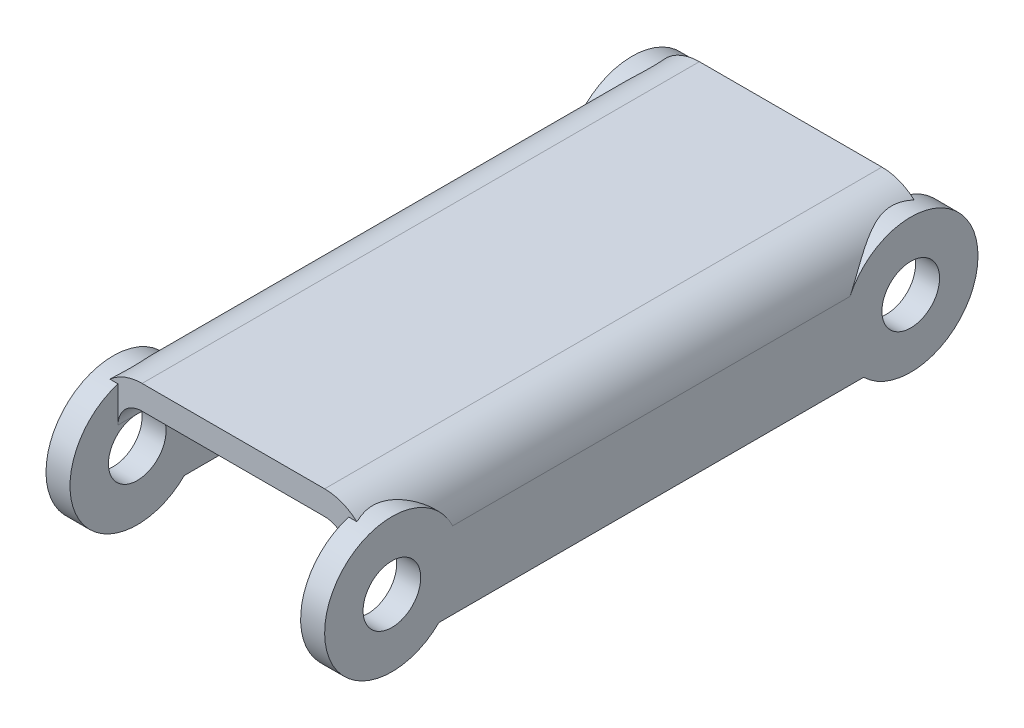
ISO-10303-21;
HEADER;
FILE_DESCRIPTION(('STEP AP214'),'2;1');
FILE_NAME('part.step','',(''),(''),'','','');
FILE_SCHEMA(('AUTOMOTIVE_DESIGN { 1 0 10303 214 1 1 1 1 }'));
ENDSEC;
DATA;
#1=APPLICATION_CONTEXT('core data for automotive mechanical design processes');
#2=APPLICATION_PROTOCOL_DEFINITION('international standard','automotive_design',2000,#1);
#3=PRODUCT_CONTEXT('',#1,'mechanical');
#4=PRODUCT('Part','Part','',(#3));
#5=PRODUCT_RELATED_PRODUCT_CATEGORY('part','',(#4));
#6=PRODUCT_DEFINITION_FORMATION('','',#4);
#7=PRODUCT_DEFINITION_CONTEXT('part definition',#1,'design');
#8=PRODUCT_DEFINITION('design','',#6,#7);
#9=PRODUCT_DEFINITION_SHAPE('','',#8);
#10=(LENGTH_UNIT() NAMED_UNIT(*) SI_UNIT(.MILLI.,.METRE.));
#11=(NAMED_UNIT(*) PLANE_ANGLE_UNIT() SI_UNIT($,.RADIAN.));
#12=(NAMED_UNIT(*) SI_UNIT($,.STERADIAN.) SOLID_ANGLE_UNIT());
#13=UNCERTAINTY_MEASURE_WITH_UNIT(LENGTH_MEASURE(1.E-05),#10,'distance_accuracy_value','');
#14=(GEOMETRIC_REPRESENTATION_CONTEXT(3) GLOBAL_UNCERTAINTY_ASSIGNED_CONTEXT((#13)) GLOBAL_UNIT_ASSIGNED_CONTEXT((#10,
#11,#12)) REPRESENTATION_CONTEXT('',''));
#15=CARTESIAN_POINT('',(0.,0.,0.));
#16=DIRECTION('',(0.,0.,1.));
#17=DIRECTION('',(1.,0.,0.));
#18=AXIS2_PLACEMENT_3D('',#15,#16,#17);
#19=CARTESIAN_POINT('',(-6.,4.,0.));
#20=DIRECTION('',(1.,0.,0.));
#21=DIRECTION('',(0.,0.,-1.));
#22=AXIS2_PLACEMENT_3D('',#19,#20,#21);
#23=PLANE('',#22);
#24=DIRECTION('',(0.,0.,-1.));
#25=VECTOR('',#24,1.);
#26=CARTESIAN_POINT('',(-6.,4.,0.));
#27=LINE('',#26,#25);
#28=CARTESIAN_POINT('',(-6.,4.,1.));
#29=VERTEX_POINT('',#28);
#30=CARTESIAN_POINT('',(-6.,4.,27.9999999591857));
#31=VERTEX_POINT('',#30);
#32=EDGE_CURVE('E34',#29,#31,#27,.F.);
#33=ORIENTED_EDGE('',*,*,#32,.T.);
#34=CARTESIAN_POINT('',(-6.,2.5,28.));
#35=DIRECTION('',(-1.,0.,0.));
#36=DIRECTION('',(0.,-1.,0.));
#37=AXIS2_PLACEMENT_3D('',#34,#35,#36);
#38=CIRCLE('',#37,1.5);
#39=CARTESIAN_POINT('',(-6.,0.999999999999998,28.));
#40=VERTEX_POINT('',#39);
#41=EDGE_CURVE('E118',#31,#40,#38,.T.);
#42=ORIENTED_EDGE('',*,*,#41,.T.);
#43=EDGE_CURVE('E108',#40,#31,#38,.T.);
#44=ORIENTED_EDGE('',*,*,#43,.T.);
#45=CARTESIAN_POINT('',(-6.,4.,29.));
#46=VERTEX_POINT('',#45);
#47=EDGE_CURVE('E302',#31,#46,#27,.F.);
#48=ORIENTED_EDGE('',*,*,#47,.T.);
#49=DIRECTION('',(0.,1.,0.));
#50=VECTOR('',#49,1.);
#51=CARTESIAN_POINT('',(-6.00000000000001,4.18092071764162,29.));
#52=LINE('',#51,#50);
#53=CARTESIAN_POINT('',(-6.00000000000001,5.85410196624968,29.));
#54=VERTEX_POINT('',#53);
#55=EDGE_CURVE('E156',#54,#46,#52,.F.);
#56=ORIENTED_EDGE('',*,*,#55,.F.);
#57=CARTESIAN_POINT('',(-6.00000000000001,2.5,28.));
#58=DIRECTION('',(-1.,0.,0.));
#59=DIRECTION('',(0.,-1.,0.));
#60=AXIS2_PLACEMENT_3D('',#57,#58,#59);
#61=CIRCLE('',#60,3.5);
#62=CARTESIAN_POINT('',(-6.,0.,25.5505102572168));
#63=VERTEX_POINT('',#62);
#64=EDGE_CURVE('E166',#63,#54,#61,.T.);
#65=ORIENTED_EDGE('',*,*,#64,.F.);
#66=DIRECTION('',(0.,0.,-1.));
#67=VECTOR('',#66,1.);
#68=CARTESIAN_POINT('',(-6.,0.,0.));
#69=LINE('',#68,#67);
#70=CARTESIAN_POINT('',(-6.,0.,3.44948974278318));
#71=VERTEX_POINT('',#70);
#72=EDGE_CURVE('E171',#63,#71,#69,.T.);
#73=ORIENTED_EDGE('',*,*,#72,.T.);
#74=CARTESIAN_POINT('',(-6.,2.5,1.));
#75=DIRECTION('',(-1.,0.,0.));
#76=DIRECTION('',(0.,-1.,0.));
#77=AXIS2_PLACEMENT_3D('',#74,#75,#76);
#78=CIRCLE('',#77,3.5);
#79=CARTESIAN_POINT('',(-6.,5.85410196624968,0.));
#80=VERTEX_POINT('',#79);
#81=EDGE_CURVE('E174',#80,#71,#78,.T.);
#82=ORIENTED_EDGE('',*,*,#81,.F.);
#83=DIRECTION('',(0.,1.,0.));
#84=VECTOR('',#83,1.);
#85=CARTESIAN_POINT('',(-6.,4.,0.));
#86=LINE('',#85,#84);
#87=CARTESIAN_POINT('',(-6.,4.,0.));
#88=VERTEX_POINT('',#87);
#89=EDGE_CURVE('E153',#80,#88,#86,.F.);
#90=ORIENTED_EDGE('',*,*,#89,.T.);
#91=EDGE_CURVE('E106',#88,#29,#27,.F.);
#92=ORIENTED_EDGE('',*,*,#91,.T.);
#93=CARTESIAN_POINT('',(-6.,2.5,1.));
#94=DIRECTION('',(-1.,0.,0.));
#95=DIRECTION('',(0.,0.,1.));
#96=AXIS2_PLACEMENT_3D('',#93,#94,#95);
#97=CIRCLE('',#96,1.5);
#98=CARTESIAN_POINT('',(-6.,2.5,2.5));
#99=VERTEX_POINT('',#98);
#100=EDGE_CURVE('E102',#29,#99,#97,.T.);
#101=ORIENTED_EDGE('',*,*,#100,.T.);
#102=EDGE_CURVE('E104',#99,#29,#97,.T.);
#103=ORIENTED_EDGE('',*,*,#102,.T.);
#104=EDGE_LOOP('',(#33,#42,#44,#48,#56,#65,#73,#82,#90,#92,#101,#103));
#105=FACE_BOUND('',#104,.T.);
#106=ADVANCED_FACE('F16',(#105),#23,.T.);
#107=CARTESIAN_POINT('',(0.,4.18092071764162,0.));
#108=DIRECTION('',(0.,0.,1.));
#109=DIRECTION('',(1.,0.,0.));
#110=AXIS2_PLACEMENT_3D('',#107,#108,#109);
#111=PLANE('',#110);
#112=DIRECTION('',(1.,0.,0.));
#113=VECTOR('',#112,1.);
#114=CARTESIAN_POINT('',(0.,5.85410196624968,0.));
#115=LINE('',#114,#113);
#116=CARTESIAN_POINT('',(-6.42699311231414,5.85410196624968,0.));
#117=VERTEX_POINT('',#116);
#118=EDGE_CURVE('E181',#117,#80,#115,.T.);
#119=ORIENTED_EDGE('',*,*,#118,.F.);
#120=CARTESIAN_POINT('',(-4.75,4.,0.));
#121=DIRECTION('',(0.,0.,1.));
#122=DIRECTION('',(1.,0.,0.));
#123=AXIS2_PLACEMENT_3D('',#120,#121,#122);
#124=CIRCLE('',#123,2.5);
#125=CARTESIAN_POINT('',(-4.75,6.5,0.));
#126=VERTEX_POINT('',#125);
#127=EDGE_CURVE('E184',#126,#117,#124,.T.);
#128=ORIENTED_EDGE('',*,*,#127,.F.);
#129=DIRECTION('',(1.,0.,0.));
#130=VECTOR('',#129,1.);
#131=CARTESIAN_POINT('',(-4.75,6.5,0.));
#132=LINE('',#131,#130);
#133=CARTESIAN_POINT('',(4.75,6.5,0.));
#134=VERTEX_POINT('',#133);
#135=EDGE_CURVE('E458',#134,#126,#132,.F.);
#136=ORIENTED_EDGE('',*,*,#135,.F.);
#137=CARTESIAN_POINT('',(4.75,4.,0.));
#138=DIRECTION('',(0.,0.,1.));
#139=DIRECTION('',(1.,0.,0.));
#140=AXIS2_PLACEMENT_3D('',#137,#138,#139);
#141=CIRCLE('',#140,2.5);
#142=CARTESIAN_POINT('',(6.42699311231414,5.85410196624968,0.));
#143=VERTEX_POINT('',#142);
#144=EDGE_CURVE('E147',#143,#134,#141,.T.);
#145=ORIENTED_EDGE('',*,*,#144,.F.);
#146=DIRECTION('',(1.,0.,0.));
#147=VECTOR('',#146,1.);
#148=CARTESIAN_POINT('',(6.00000000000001,5.85410196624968,0.));
#149=LINE('',#148,#147);
#150=CARTESIAN_POINT('',(6.,5.85410196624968,0.));
#151=VERTEX_POINT('',#150);
#152=EDGE_CURVE('E144',#151,#143,#149,.T.);
#153=ORIENTED_EDGE('',*,*,#152,.F.);
#154=DIRECTION('',(0.,1.,0.));
#155=VECTOR('',#154,1.);
#156=CARTESIAN_POINT('',(6.,4.92705098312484,0.));
#157=LINE('',#156,#155);
#158=CARTESIAN_POINT('',(6.,4.,0.));
#159=VERTEX_POINT('',#158);
#160=EDGE_CURVE('E92',#159,#151,#157,.T.);
#161=ORIENTED_EDGE('',*,*,#160,.F.);
#162=CARTESIAN_POINT('',(4.75,4.,0.));
#163=DIRECTION('',(0.,0.,1.));
#164=DIRECTION('',(1.,0.,0.));
#165=AXIS2_PLACEMENT_3D('',#162,#163,#164);
#166=CIRCLE('',#165,1.25);
#167=CARTESIAN_POINT('',(4.75,5.25,0.));
#168=VERTEX_POINT('',#167);
#169=EDGE_CURVE('E146',#168,#159,#166,.F.);
#170=ORIENTED_EDGE('',*,*,#169,.F.);
#171=DIRECTION('',(1.,0.,0.));
#172=VECTOR('',#171,1.);
#173=CARTESIAN_POINT('',(0.,5.25,0.));
#174=LINE('',#173,#172);
#175=CARTESIAN_POINT('',(-4.75,5.25,0.));
#176=VERTEX_POINT('',#175);
#177=EDGE_CURVE('E149',#176,#168,#174,.T.);
#178=ORIENTED_EDGE('',*,*,#177,.F.);
#179=CARTESIAN_POINT('',(-4.75,4.,0.));
#180=DIRECTION('',(0.,0.,1.));
#181=DIRECTION('',(1.,0.,0.));
#182=AXIS2_PLACEMENT_3D('',#179,#180,#181);
#183=CIRCLE('',#182,1.25);
#184=EDGE_CURVE('E150',#88,#176,#183,.F.);
#185=ORIENTED_EDGE('',*,*,#184,.F.);
#186=ORIENTED_EDGE('',*,*,#89,.F.);
#187=EDGE_LOOP('',(#119,#128,#136,#145,#153,#161,#170,#178,#185,#186));
#188=FACE_BOUND('',#187,.T.);
#189=ADVANCED_FACE('F261',(#188),#111,.F.);
#190=CARTESIAN_POINT('',(0.,4.18092071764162,29.));
#191=DIRECTION('',(0.,0.,1.));
#192=DIRECTION('',(1.,0.,0.));
#193=AXIS2_PLACEMENT_3D('',#190,#191,#192);
#194=PLANE('',#193);
#195=CARTESIAN_POINT('',(-4.75,4.,29.));
#196=DIRECTION('',(0.,0.,1.));
#197=DIRECTION('',(1.,0.,0.));
#198=AXIS2_PLACEMENT_3D('',#195,#196,#197);
#199=CIRCLE('',#198,2.5);
#200=CARTESIAN_POINT('',(-6.42699311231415,5.85410196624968,29.));
#201=VERTEX_POINT('',#200);
#202=CARTESIAN_POINT('',(-4.75,6.5,29.));
#203=VERTEX_POINT('',#202);
#204=EDGE_CURVE('E155',#201,#203,#199,.F.);
#205=ORIENTED_EDGE('',*,*,#204,.F.);
#206=DIRECTION('',(1.,0.,0.));
#207=VECTOR('',#206,1.);
#208=CARTESIAN_POINT('',(0.,5.85410196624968,29.));
#209=LINE('',#208,#207);
#210=EDGE_CURVE('E160',#201,#54,#209,.T.);
#211=ORIENTED_EDGE('',*,*,#210,.T.);
#212=ORIENTED_EDGE('',*,*,#55,.T.);
#213=CARTESIAN_POINT('',(-4.75,4.,29.));
#214=DIRECTION('',(0.,0.,1.));
#215=DIRECTION('',(1.,0.,0.));
#216=AXIS2_PLACEMENT_3D('',#213,#214,#215);
#217=CIRCLE('',#216,1.25);
#218=CARTESIAN_POINT('',(-4.75,5.25,29.));
#219=VERTEX_POINT('',#218);
#220=EDGE_CURVE('E159',#46,#219,#217,.F.);
#221=ORIENTED_EDGE('',*,*,#220,.T.);
#222=DIRECTION('',(1.,0.,0.));
#223=VECTOR('',#222,1.);
#224=CARTESIAN_POINT('',(0.,5.25,29.));
#225=LINE('',#224,#223);
#226=CARTESIAN_POINT('',(4.75,5.25,29.));
#227=VERTEX_POINT('',#226);
#228=EDGE_CURVE('E131',#219,#227,#225,.T.);
#229=ORIENTED_EDGE('',*,*,#228,.T.);
#230=CARTESIAN_POINT('',(4.75,4.,29.));
#231=DIRECTION('',(0.,0.,1.));
#232=DIRECTION('',(1.,0.,0.));
#233=AXIS2_PLACEMENT_3D('',#230,#231,#232);
#234=CIRCLE('',#233,1.25);
#235=CARTESIAN_POINT('',(6.,4.,29.));
#236=VERTEX_POINT('',#235);
#237=EDGE_CURVE('E127',#227,#236,#234,.F.);
#238=ORIENTED_EDGE('',*,*,#237,.T.);
#239=DIRECTION('',(0.,1.,0.));
#240=VECTOR('',#239,1.);
#241=CARTESIAN_POINT('',(6.,4.92705098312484,29.));
#242=LINE('',#241,#240);
#243=CARTESIAN_POINT('',(6.,5.85410196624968,29.));
#244=VERTEX_POINT('',#243);
#245=EDGE_CURVE('E189',#236,#244,#242,.T.);
#246=ORIENTED_EDGE('',*,*,#245,.T.);
#247=DIRECTION('',(1.,0.,0.));
#248=VECTOR('',#247,1.);
#249=CARTESIAN_POINT('',(0.,5.85410196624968,29.));
#250=LINE('',#249,#248);
#251=CARTESIAN_POINT('',(6.42699311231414,5.85410196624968,29.));
#252=VERTEX_POINT('',#251);
#253=EDGE_CURVE('E130',#244,#252,#250,.T.);
#254=ORIENTED_EDGE('',*,*,#253,.T.);
#255=CARTESIAN_POINT('',(4.75,4.,29.));
#256=DIRECTION('',(0.,0.,1.));
#257=DIRECTION('',(1.,0.,0.));
#258=AXIS2_PLACEMENT_3D('',#255,#256,#257);
#259=CIRCLE('',#258,2.5);
#260=CARTESIAN_POINT('',(4.75,6.5,29.));
#261=VERTEX_POINT('',#260);
#262=EDGE_CURVE('E134',#261,#252,#259,.F.);
#263=ORIENTED_EDGE('',*,*,#262,.F.);
#264=DIRECTION('',(1.,0.,0.));
#265=VECTOR('',#264,1.);
#266=CARTESIAN_POINT('',(-4.75,6.5,29.));
#267=LINE('',#266,#265);
#268=EDGE_CURVE('E167',#203,#261,#267,.T.);
#269=ORIENTED_EDGE('',*,*,#268,.F.);
#270=EDGE_LOOP('',(#205,#211,#212,#221,#229,#238,#246,#254,#263,#269));
#271=FACE_BOUND('',#270,.T.);
#272=ADVANCED_FACE('F264',(#271),#194,.T.);
#273=CARTESIAN_POINT('',(-6.,2.5,28.));
#274=DIRECTION('',(-1.,0.,0.));
#275=DIRECTION('',(0.,-1.,0.));
#276=AXIS2_PLACEMENT_3D('',#273,#274,#275);
#277=CYLINDRICAL_SURFACE('',#276,3.5);
#278=DIRECTION('',(1.,0.,0.));
#279=VECTOR('',#278,1.);
#280=CARTESIAN_POINT('',(-6.,0.,25.5505102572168));
#281=LINE('',#280,#279);
#282=CARTESIAN_POINT('',(-7.25,0.,25.5505102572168));
#283=VERTEX_POINT('',#282);
#284=EDGE_CURVE('E163',#63,#283,#281,.F.);
#285=ORIENTED_EDGE('',*,*,#284,.F.);
#286=ORIENTED_EDGE('',*,*,#64,.T.);
#287=ORIENTED_EDGE('',*,*,#210,.F.);
#288=CARTESIAN_POINT('',(-7.25,4.00000000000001,24.8377223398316));
#289=CARTESIAN_POINT('',(-7.25000848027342,4.0707857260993,24.8712794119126));
#290=CARTESIAN_POINT('',(-7.24699492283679,4.14037838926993,24.9072196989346));
#291=CARTESIAN_POINT('',(-7.23559098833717,4.27656009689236,24.9833996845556));
#292=CARTESIAN_POINT('',(-7.22721003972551,4.34315418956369,25.0236317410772));
#293=CARTESIAN_POINT('',(-7.20585107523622,4.47226500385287,25.1075884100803));
#294=CARTESIAN_POINT('',(-7.1929241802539,4.53481826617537,25.1512701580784));
#295=CARTESIAN_POINT('',(-7.16311349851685,4.65635681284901,25.2421220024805));
#296=CARTESIAN_POINT('',(-7.14622760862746,4.71534017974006,25.2892939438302));
#297=CARTESIAN_POINT('',(-7.0811048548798,4.9157656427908,25.4604065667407));
#298=CARTESIAN_POINT('',(-7.02400217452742,5.04736575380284,25.5928028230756));
#299=CARTESIAN_POINT('',(-6.92963102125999,5.22630337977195,25.8032146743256));
#300=CARTESIAN_POINT('',(-6.89659513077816,5.28303150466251,25.8755851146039));
#301=CARTESIAN_POINT('',(-6.82873119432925,5.39028431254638,26.0239895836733));
#302=CARTESIAN_POINT('',(-6.79390392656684,5.4408116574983,26.1000220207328));
#303=CARTESIAN_POINT('',(-6.72277286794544,5.53682326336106,26.2574670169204));
#304=CARTESIAN_POINT('',(-6.68645378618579,5.58215434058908,26.3389655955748));
#305=CARTESIAN_POINT('',(-6.61453470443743,5.66630475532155,26.5056011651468));
#306=CARTESIAN_POINT('',(-6.57893489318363,5.70512240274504,26.590739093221));
#307=CARTESIAN_POINT('',(-6.51019042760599,5.77599515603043,26.7644328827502));
#308=CARTESIAN_POINT('',(-6.47703883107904,5.8080699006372,26.8529779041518));
#309=CARTESIAN_POINT('',(-6.41506511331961,5.86529787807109,27.0336923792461));
#310=CARTESIAN_POINT('',(-6.38624010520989,5.89045573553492,27.1258593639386));
#311=CARTESIAN_POINT('',(-6.3279362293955,5.93957897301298,27.3407205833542));
#312=CARTESIAN_POINT('',(-6.30063089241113,5.96114277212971,27.4646028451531));
#313=CARTESIAN_POINT('',(-6.26244533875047,5.9907635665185,27.7162520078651));
#314=CARTESIAN_POINT('',(-6.25151493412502,5.99886184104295,27.844005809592));
#315=CARTESIAN_POINT('',(-6.24878036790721,6.00091667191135,28.100307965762));
#316=CARTESIAN_POINT('',(-6.25704586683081,5.99482172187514,28.2288575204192));
#317=CARTESIAN_POINT('',(-6.29067523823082,5.96893858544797,28.4825093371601));
#318=CARTESIAN_POINT('',(-6.31608761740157,5.94911154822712,28.6076007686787));
#319=CARTESIAN_POINT('',(-6.35920898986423,5.91329000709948,28.775677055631));
#320=CARTESIAN_POINT('',(-6.37185499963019,5.90260233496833,28.8212660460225));
#321=CARTESIAN_POINT('',(-6.39848345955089,5.87957777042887,28.9113715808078));
#322=CARTESIAN_POINT('',(-6.41245897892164,5.86724931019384,28.9558923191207));
#323=CARTESIAN_POINT('',(-6.42699311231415,5.85410196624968,29.));
#324=B_SPLINE_CURVE_WITH_KNOTS('',3,(#288,#289,#290,#291,#292,#293,#294,#295,#296,#297,#298,
#299,#300,#301,#302,#303,#304,#305,#306,#307,#308,#309,#310,#311,#312,#313,#314,#315,#316,#317,
#318,#319,#320,#321,#322,#323),.UNSPECIFIED.,.F.,.F.,(4,2,2,2,2,2,2,2,2,2,2,2,2,2,2,2,2,4),(0.,
0.234824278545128,0.469237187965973,0.701094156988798,0.93307457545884,1.51502190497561,
1.80797310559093,2.10079810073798,2.40076999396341,2.70081960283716,2.99998282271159,
3.29894553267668,3.68346375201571,4.06680102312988,4.45153156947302,4.8373550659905,
4.98282805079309,5.12758039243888),.UNSPECIFIED.);
#325=CARTESIAN_POINT('',(-7.25,4.,24.8377223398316));
#326=VERTEX_POINT('',#325);
#327=EDGE_CURVE('E170',#326,#201,#324,.T.);
#328=ORIENTED_EDGE('',*,*,#327,.F.);
#329=CARTESIAN_POINT('',(-7.25,2.5,28.));
#330=DIRECTION('',(-1.,0.,0.));
#331=DIRECTION('',(0.,-1.,0.));
#332=AXIS2_PLACEMENT_3D('',#329,#330,#331);
#333=CIRCLE('',#332,3.5);
#334=EDGE_CURVE('E284',#326,#283,#333,.F.);
#335=ORIENTED_EDGE('',*,*,#334,.T.);
#336=EDGE_LOOP('',(#285,#286,#287,#328,#335));
#337=FACE_BOUND('',#336,.T.);
#338=ADVANCED_FACE('F267',(#337),#277,.T.);
#339=CARTESIAN_POINT('',(-6.,2.5,1.));
#340=DIRECTION('',(-1.,0.,0.));
#341=DIRECTION('',(0.,-1.,0.));
#342=AXIS2_PLACEMENT_3D('',#339,#340,#341);
#343=CYLINDRICAL_SURFACE('',#342,3.5);
#344=CARTESIAN_POINT('',(-7.25000000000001,2.5,1.));
#345=DIRECTION('',(-1.,0.,0.));
#346=DIRECTION('',(0.,-1.,0.));
#347=AXIS2_PLACEMENT_3D('',#344,#345,#346);
#348=CIRCLE('',#347,3.5);
#349=CARTESIAN_POINT('',(-7.25,4.,4.16227766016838));
#350=VERTEX_POINT('',#349);
#351=CARTESIAN_POINT('',(-7.25,0.,3.44948974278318));
#352=VERTEX_POINT('',#351);
#353=EDGE_CURVE('E298',#350,#352,#348,.T.);
#354=ORIENTED_EDGE('',*,*,#353,.F.);
#355=CARTESIAN_POINT('',(-6.42699311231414,5.85410196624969,0.));
#356=CARTESIAN_POINT('',(-6.40675659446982,5.87241408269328,0.0614595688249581));
#357=CARTESIAN_POINT('',(-6.38758319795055,5.88914674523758,0.123725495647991));
#358=CARTESIAN_POINT('',(-6.35211088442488,5.91931517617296,0.249976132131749));
#359=CARTESIAN_POINT('',(-6.335817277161,5.93274487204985,0.313963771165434));
#360=CARTESIAN_POINT('',(-6.29259716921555,5.96769280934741,0.507846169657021));
#361=CARTESIAN_POINT('',(-6.27116921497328,5.98400858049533,0.640117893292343));
#362=CARTESIAN_POINT('',(-6.25393094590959,5.99705391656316,0.841163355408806));
#363=CARTESIAN_POINT('',(-6.25069427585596,5.99947776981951,0.909019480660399));
#364=CARTESIAN_POINT('',(-6.24950856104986,6.00037009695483,1.0448303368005));
#365=CARTESIAN_POINT('',(-6.25156015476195,5.99883809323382,1.11278507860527));
#366=CARTESIAN_POINT('',(-6.26080509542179,5.99185803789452,1.2480024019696));
#367=CARTESIAN_POINT('',(-6.26798873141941,5.98641738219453,1.31526604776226));
#368=CARTESIAN_POINT('',(-6.28697326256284,5.97176493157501,1.44873584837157));
#369=CARTESIAN_POINT('',(-6.29877702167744,5.962550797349,1.51494132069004));
#370=CARTESIAN_POINT('',(-6.34739302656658,5.92362066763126,1.74640191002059));
#371=CARTESIAN_POINT('',(-6.39480195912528,5.88413035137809,1.90789800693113));
#372=CARTESIAN_POINT('',(-6.47536473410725,5.80955070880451,2.14177623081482));
#373=CARTESIAN_POINT('',(-6.50388405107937,5.7820379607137,2.21853773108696));
#374=CARTESIAN_POINT('',(-6.56283788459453,5.72203033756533,2.3693369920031));
#375=CARTESIAN_POINT('',(-6.59327193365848,5.68953667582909,2.44337541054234));
#376=CARTESIAN_POINT('',(-6.68940330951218,5.58063866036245,2.66999672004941));
#377=CARTESIAN_POINT('',(-6.75652713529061,5.49571959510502,2.81796246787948));
#378=CARTESIAN_POINT('',(-6.88593469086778,5.30428217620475,3.10121853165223));
#379=CARTESIAN_POINT('',(-6.9482259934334,5.19779860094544,3.23652875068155));
#380=CARTESIAN_POINT('',(-7.05303563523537,4.97911550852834,3.47517204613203));
#381=CARTESIAN_POINT('',(-7.09709266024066,4.86968407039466,3.58034832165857));
#382=CARTESIAN_POINT('',(-7.17102492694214,4.63532593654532,3.77734573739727));
#383=CARTESIAN_POINT('',(-7.20094242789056,4.51044683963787,3.86920609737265));
#384=CARTESIAN_POINT('',(-7.23039750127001,4.31841716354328,3.99140970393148));
#385=CARTESIAN_POINT('',(-7.23761747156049,4.25646039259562,4.02820892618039));
#386=CARTESIAN_POINT('',(-7.24742374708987,4.1300160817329,4.09810947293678));
#387=CARTESIAN_POINT('',(-7.25000255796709,4.06552462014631,4.13120473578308));
#388=CARTESIAN_POINT('',(-7.25,4.,4.16227766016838));
#389=B_SPLINE_CURVE_WITH_KNOTS('',3,(#355,#356,#357,#358,#359,#360,#361,#362,#363,#364,#365,
#366,#367,#368,#369,#370,#371,#372,#373,#374,#375,#376,#377,#378,#379,#380,#381,#382,#383,#384,
#385,#386,#387,#388),.UNSPECIFIED.,.F.,.F.,(4,2,2,2,2,2,2,2,2,2,2,2,2,2,2,2,4),(0.,
0.20166082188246,0.403689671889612,0.806246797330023,1.00990143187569,1.21358065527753,
1.41687549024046,1.62029654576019,2.13558825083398,2.39464094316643,2.65363063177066,
3.20183544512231,3.74916307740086,4.22172033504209,4.69285617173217,4.90986927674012,
5.12723249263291),.UNSPECIFIED.);
#390=EDGE_CURVE('E178',#117,#350,#389,.T.);
#391=ORIENTED_EDGE('',*,*,#390,.F.);
#392=ORIENTED_EDGE('',*,*,#118,.T.);
#393=ORIENTED_EDGE('',*,*,#81,.T.);
#394=DIRECTION('',(-1.,0.,0.));
#395=VECTOR('',#394,1.);
#396=CARTESIAN_POINT('',(-6.625,0.,3.44948974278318));
#397=LINE('',#396,#395);
#398=EDGE_CURVE('E177',#71,#352,#397,.T.);
#399=ORIENTED_EDGE('',*,*,#398,.T.);
#400=EDGE_LOOP('',(#354,#391,#392,#393,#399));
#401=FACE_BOUND('',#400,.T.);
#402=ADVANCED_FACE('F272',(#401),#343,.T.);
#403=CARTESIAN_POINT('',(-6.,0.,0.));
#404=DIRECTION('',(0.,-1.,0.));
#405=DIRECTION('',(0.,0.,-1.));
#406=AXIS2_PLACEMENT_3D('',#403,#404,#405);
#407=PLANE('',#406);
#408=ORIENTED_EDGE('',*,*,#284,.T.);
#409=DIRECTION('',(0.,0.,1.));
#410=VECTOR('',#409,1.);
#411=CARTESIAN_POINT('',(-7.25,0.,0.));
#412=LINE('',#411,#410);
#413=EDGE_CURVE('E173',#352,#283,#412,.T.);
#414=ORIENTED_EDGE('',*,*,#413,.F.);
#415=ORIENTED_EDGE('',*,*,#398,.F.);
#416=ORIENTED_EDGE('',*,*,#72,.F.);
#417=EDGE_LOOP('',(#408,#414,#415,#416));
#418=FACE_BOUND('',#417,.T.);
#419=ADVANCED_FACE('F468',(#418),#407,.T.);
#420=CARTESIAN_POINT('',(-4.75,4.,0.));
#421=DIRECTION('',(0.,0.,1.));
#422=DIRECTION('',(1.,0.,0.));
#423=AXIS2_PLACEMENT_3D('',#420,#421,#422);
#424=CYLINDRICAL_SURFACE('',#423,1.25);
#425=ORIENTED_EDGE('',*,*,#47,.F.);
#426=ORIENTED_EDGE('',*,*,#32,.F.);
#427=ORIENTED_EDGE('',*,*,#91,.F.);
#428=ORIENTED_EDGE('',*,*,#184,.T.);
#429=DIRECTION('',(0.,0.,-1.));
#430=VECTOR('',#429,1.);
#431=CARTESIAN_POINT('',(-4.75,5.25,0.));
#432=LINE('',#431,#430);
#433=EDGE_CURVE('E303',#219,#176,#432,.T.);
#434=ORIENTED_EDGE('',*,*,#433,.F.);
#435=ORIENTED_EDGE('',*,*,#220,.F.);
#436=EDGE_LOOP('',(#425,#426,#427,#428,#434,#435));
#437=FACE_BOUND('',#436,.T.);
#438=ADVANCED_FACE('F479',(#437),#424,.F.);
#439=CARTESIAN_POINT('',(4.75,4.,0.));
#440=DIRECTION('',(0.,0.,1.));
#441=DIRECTION('',(1.,0.,0.));
#442=AXIS2_PLACEMENT_3D('',#439,#440,#441);
#443=CYLINDRICAL_SURFACE('',#442,1.25);
#444=DIRECTION('',(0.,0.,1.));
#445=VECTOR('',#444,1.);
#446=CARTESIAN_POINT('',(4.75,5.25,0.));
#447=LINE('',#446,#445);
#448=EDGE_CURVE('E139',#168,#227,#447,.T.);
#449=ORIENTED_EDGE('',*,*,#448,.F.);
#450=ORIENTED_EDGE('',*,*,#169,.T.);
#451=DIRECTION('',(0.,0.,1.));
#452=VECTOR('',#451,1.);
#453=CARTESIAN_POINT('',(6.,4.,14.5));
#454=LINE('',#453,#452);
#455=CARTESIAN_POINT('',(6.,4.,1.));
#456=VERTEX_POINT('',#455);
#457=EDGE_CURVE('E19',#159,#456,#454,.T.);
#458=ORIENTED_EDGE('',*,*,#457,.T.);
#459=DIRECTION('',(0.,0.,1.));
#460=VECTOR('',#459,1.);
#461=CARTESIAN_POINT('',(6.,4.,14.5));
#462=LINE('',#461,#460);
#463=CARTESIAN_POINT('',(6.,4.,28.));
#464=VERTEX_POINT('',#463);
#465=EDGE_CURVE('E126',#456,#464,#462,.T.);
#466=ORIENTED_EDGE('',*,*,#465,.T.);
#467=DIRECTION('',(0.,0.,1.));
#468=VECTOR('',#467,1.);
#469=CARTESIAN_POINT('',(6.,4.,14.5));
#470=LINE('',#469,#468);
#471=EDGE_CURVE('E25',#464,#236,#470,.T.);
#472=ORIENTED_EDGE('',*,*,#471,.T.);
#473=ORIENTED_EDGE('',*,*,#237,.F.);
#474=EDGE_LOOP('',(#449,#450,#458,#466,#472,#473));
#475=FACE_BOUND('',#474,.T.);
#476=ADVANCED_FACE('F206',(#475),#443,.F.);
#477=CARTESIAN_POINT('',(6.,2.5,28.));
#478=DIRECTION('',(1.,0.,0.));
#479=DIRECTION('',(0.,1.,0.));
#480=AXIS2_PLACEMENT_3D('',#477,#478,#479);
#481=CYLINDRICAL_SURFACE('',#480,3.5);
#482=ORIENTED_EDGE('',*,*,#253,.F.);
#483=CARTESIAN_POINT('',(6.,2.5,28.));
#484=DIRECTION('',(1.,0.,0.));
#485=DIRECTION('',(0.,1.,0.));
#486=AXIS2_PLACEMENT_3D('',#483,#484,#485);
#487=CIRCLE('',#486,3.5);
#488=CARTESIAN_POINT('',(6.,0.,25.5505102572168));
#489=VERTEX_POINT('',#488);
#490=EDGE_CURVE('E187',#244,#489,#487,.T.);
#491=ORIENTED_EDGE('',*,*,#490,.T.);
#492=DIRECTION('',(1.,0.,0.));
#493=VECTOR('',#492,1.);
#494=CARTESIAN_POINT('',(6.,0.,25.5505102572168));
#495=LINE('',#494,#493);
#496=CARTESIAN_POINT('',(7.25,0.,25.5505102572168));
#497=VERTEX_POINT('',#496);
#498=EDGE_CURVE('E135',#489,#497,#495,.T.);
#499=ORIENTED_EDGE('',*,*,#498,.T.);
#500=CARTESIAN_POINT('',(7.25,2.5,28.));
#501=DIRECTION('',(1.,0.,0.));
#502=DIRECTION('',(0.,1.,0.));
#503=AXIS2_PLACEMENT_3D('',#500,#501,#502);
#504=CIRCLE('',#503,3.5);
#505=CARTESIAN_POINT('',(7.25,4.,24.8377223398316));
#506=VERTEX_POINT('',#505);
#507=EDGE_CURVE('E138',#506,#497,#504,.T.);
#508=ORIENTED_EDGE('',*,*,#507,.F.);
#509=CARTESIAN_POINT('',(6.42699311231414,5.85410196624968,29.));
#510=CARTESIAN_POINT('',(6.40675659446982,5.87241408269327,28.938540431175));
#511=CARTESIAN_POINT('',(6.38758319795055,5.88914674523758,28.876274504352));
#512=CARTESIAN_POINT('',(6.35211088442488,5.91931517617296,28.7500238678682));
#513=CARTESIAN_POINT('',(6.335817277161,5.93274487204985,28.6860362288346));
#514=CARTESIAN_POINT('',(6.29259716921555,5.96769280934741,28.492153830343));
#515=CARTESIAN_POINT('',(6.27116921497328,5.98400858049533,28.3598821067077));
#516=CARTESIAN_POINT('',(6.25393094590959,5.99705391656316,28.1588366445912));
#517=CARTESIAN_POINT('',(6.25069427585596,5.9994777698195,28.0909805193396));
#518=CARTESIAN_POINT('',(6.24950856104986,6.00037009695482,27.9551696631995));
#519=CARTESIAN_POINT('',(6.25156015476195,5.99883809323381,27.8872149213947));
#520=CARTESIAN_POINT('',(6.26080509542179,5.99185803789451,27.7519975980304));
#521=CARTESIAN_POINT('',(6.26798873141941,5.98641738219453,27.6847339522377));
#522=CARTESIAN_POINT('',(6.28697326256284,5.97176493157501,27.5512641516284));
#523=CARTESIAN_POINT('',(6.29877702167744,5.962550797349,27.48505867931));
#524=CARTESIAN_POINT('',(6.34739302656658,5.92362066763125,27.2535980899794));
#525=CARTESIAN_POINT('',(6.39480195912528,5.88413035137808,27.0921019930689));
#526=CARTESIAN_POINT('',(6.47536473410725,5.8095507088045,26.8582237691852));
#527=CARTESIAN_POINT('',(6.50388405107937,5.78203796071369,26.781462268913));
#528=CARTESIAN_POINT('',(6.56283788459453,5.72203033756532,26.6306630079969));
#529=CARTESIAN_POINT('',(6.59327193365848,5.68953667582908,26.5566245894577));
#530=CARTESIAN_POINT('',(6.68940330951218,5.58063866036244,26.3300032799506));
#531=CARTESIAN_POINT('',(6.75652713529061,5.49571959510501,26.1820375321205));
#532=CARTESIAN_POINT('',(6.88593469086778,5.30428217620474,25.8987814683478));
#533=CARTESIAN_POINT('',(6.94822599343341,5.19779860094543,25.7634712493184));
#534=CARTESIAN_POINT('',(7.05303563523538,4.97911550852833,25.524827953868));
#535=CARTESIAN_POINT('',(7.09709266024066,4.86968407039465,25.4196516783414));
#536=CARTESIAN_POINT('',(7.17102492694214,4.63532593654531,25.2226542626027));
#537=CARTESIAN_POINT('',(7.20094242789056,4.51044683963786,25.1307939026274));
#538=CARTESIAN_POINT('',(7.23039750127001,4.31841716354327,25.0085902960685));
#539=CARTESIAN_POINT('',(7.23761747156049,4.25646039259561,24.9717910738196));
#540=CARTESIAN_POINT('',(7.24742374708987,4.13001608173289,24.9018905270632));
#541=CARTESIAN_POINT('',(7.25000255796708,4.0655246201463,24.8687952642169));
#542=CARTESIAN_POINT('',(7.25,4.,24.8377223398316));
#543=B_SPLINE_CURVE_WITH_KNOTS('',3,(#509,#510,#511,#512,#513,#514,#515,#516,#517,#518,#519,
#520,#521,#522,#523,#524,#525,#526,#527,#528,#529,#530,#531,#532,#533,#534,#535,#536,#537,#538,
#539,#540,#541,#542),.UNSPECIFIED.,.F.,.F.,(4,2,2,2,2,2,2,2,2,2,2,2,2,2,2,2,4),(0.,
0.201660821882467,0.403689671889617,0.806246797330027,1.0099014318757,1.21358065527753,
1.41687549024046,1.62029654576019,2.13558825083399,2.39464094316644,2.65363063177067,
3.20183544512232,3.74916307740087,4.2217203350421,4.69285617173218,4.90986927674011,
5.12723249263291),.UNSPECIFIED.);
#544=EDGE_CURVE('E310',#252,#506,#543,.T.);
#545=ORIENTED_EDGE('',*,*,#544,.F.);
#546=EDGE_LOOP('',(#482,#491,#499,#508,#545));
#547=FACE_BOUND('',#546,.T.);
#548=ADVANCED_FACE('F323',(#547),#481,.T.);
#549=CARTESIAN_POINT('',(6.,2.5,1.));
#550=DIRECTION('',(1.,0.,0.));
#551=DIRECTION('',(0.,1.,0.));
#552=AXIS2_PLACEMENT_3D('',#549,#550,#551);
#553=CYLINDRICAL_SURFACE('',#552,3.5);
#554=CARTESIAN_POINT('',(6.00000000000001,2.5,1.));
#555=DIRECTION('',(1.,0.,0.));
#556=DIRECTION('',(0.,1.,0.));
#557=AXIS2_PLACEMENT_3D('',#554,#555,#556);
#558=CIRCLE('',#557,3.5);
#559=CARTESIAN_POINT('',(6.,0.,3.44948974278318));
#560=VERTEX_POINT('',#559);
#561=EDGE_CURVE('E85',#560,#151,#558,.T.);
#562=ORIENTED_EDGE('',*,*,#561,.T.);
#563=ORIENTED_EDGE('',*,*,#152,.T.);
#564=CARTESIAN_POINT('',(7.25,4.,4.16227766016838));
#565=CARTESIAN_POINT('',(7.25000848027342,4.0707857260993,4.12872058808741));
#566=CARTESIAN_POINT('',(7.24699492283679,4.14037838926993,4.09278030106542));
#567=CARTESIAN_POINT('',(7.23559098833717,4.27656009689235,4.01660031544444));
#568=CARTESIAN_POINT('',(7.22721003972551,4.34315418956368,3.97636825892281));
#569=CARTESIAN_POINT('',(7.20585107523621,4.47226500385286,3.8924115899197));
#570=CARTESIAN_POINT('',(7.1929241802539,4.53481826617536,3.84872984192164));
#571=CARTESIAN_POINT('',(7.16311349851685,4.656356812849,3.75787799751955));
#572=CARTESIAN_POINT('',(7.14622760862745,4.71534017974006,3.71070605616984));
#573=CARTESIAN_POINT('',(7.08110485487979,4.91576564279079,3.53959343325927));
#574=CARTESIAN_POINT('',(7.02400217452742,5.04736575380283,3.40719717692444));
#575=CARTESIAN_POINT('',(6.92963102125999,5.22630337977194,3.19678532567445));
#576=CARTESIAN_POINT('',(6.89659513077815,5.2830315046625,3.12441488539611));
#577=CARTESIAN_POINT('',(6.82873119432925,5.39028431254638,2.97601041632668));
#578=CARTESIAN_POINT('',(6.79390392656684,5.44081165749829,2.89997797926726));
#579=CARTESIAN_POINT('',(6.72277286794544,5.53682326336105,2.74253298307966));
#580=CARTESIAN_POINT('',(6.68645378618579,5.58215434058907,2.66103440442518));
#581=CARTESIAN_POINT('',(6.61453470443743,5.66630475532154,2.49439883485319));
#582=CARTESIAN_POINT('',(6.57893489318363,5.70512240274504,2.40926090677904));
#583=CARTESIAN_POINT('',(6.51019042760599,5.77599515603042,2.23556711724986));
#584=CARTESIAN_POINT('',(6.47703883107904,5.80806990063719,2.14702209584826));
#585=CARTESIAN_POINT('',(6.41506511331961,5.86529787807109,1.96630762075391));
#586=CARTESIAN_POINT('',(6.38624010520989,5.89045573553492,1.87414063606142));
#587=CARTESIAN_POINT('',(6.3279362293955,5.93957897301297,1.65927941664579));
#588=CARTESIAN_POINT('',(6.30063089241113,5.9611427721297,1.5353971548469));
#589=CARTESIAN_POINT('',(6.26244533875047,5.9907635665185,1.28374799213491));
#590=CARTESIAN_POINT('',(6.25151493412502,5.99886184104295,1.15599419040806));
#591=CARTESIAN_POINT('',(6.24878036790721,6.00091667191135,0.899692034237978));
#592=CARTESIAN_POINT('',(6.25704586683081,5.99482172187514,0.771142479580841));
#593=CARTESIAN_POINT('',(6.29067523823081,5.96893858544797,0.517490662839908));
#594=CARTESIAN_POINT('',(6.31608761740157,5.94911154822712,0.392399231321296));
#595=CARTESIAN_POINT('',(6.35920898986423,5.91329000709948,0.224322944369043));
#596=CARTESIAN_POINT('',(6.37185499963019,5.90260233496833,0.178733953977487));
#597=CARTESIAN_POINT('',(6.39848345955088,5.87957777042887,0.0886284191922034));
#598=CARTESIAN_POINT('',(6.41245897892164,5.86724931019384,0.044107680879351));
#599=CARTESIAN_POINT('',(6.42699311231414,5.85410196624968,0.));
#600=B_SPLINE_CURVE_WITH_KNOTS('',3,(#564,#565,#566,#567,#568,#569,#570,#571,#572,#573,#574,
#575,#576,#577,#578,#579,#580,#581,#582,#583,#584,#585,#586,#587,#588,#589,#590,#591,#592,#593,
#594,#595,#596,#597,#598,#599),.UNSPECIFIED.,.F.,.F.,(4,2,2,2,2,2,2,2,2,2,2,2,2,2,2,2,2,4),(0.,
0.234824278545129,0.469237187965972,0.701094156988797,0.933074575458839,1.51502190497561,
1.80797310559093,2.10079810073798,2.4007699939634,2.70081960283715,2.99998282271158,
3.29894553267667,3.6834637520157,4.06680102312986,4.45153156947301,4.83735506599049,
4.98282805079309,5.12758039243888),.UNSPECIFIED.);
#601=CARTESIAN_POINT('',(7.25,4.,4.16227766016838));
#602=VERTEX_POINT('',#601);
#603=EDGE_CURVE('E317',#602,#143,#600,.T.);
#604=ORIENTED_EDGE('',*,*,#603,.F.);
#605=CARTESIAN_POINT('',(7.25,2.5,1.));
#606=DIRECTION('',(1.,0.,0.));
#607=DIRECTION('',(0.,1.,0.));
#608=AXIS2_PLACEMENT_3D('',#605,#606,#607);
#609=CIRCLE('',#608,3.5);
#610=CARTESIAN_POINT('',(7.25,0.,3.44948974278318));
#611=VERTEX_POINT('',#610);
#612=EDGE_CURVE('E143',#611,#602,#609,.T.);
#613=ORIENTED_EDGE('',*,*,#612,.F.);
#614=DIRECTION('',(1.,0.,0.));
#615=VECTOR('',#614,1.);
#616=CARTESIAN_POINT('',(6.,0.,3.44948974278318));
#617=LINE('',#616,#615);
#618=EDGE_CURVE('E140',#611,#560,#617,.F.);
#619=ORIENTED_EDGE('',*,*,#618,.T.);
#620=EDGE_LOOP('',(#562,#563,#604,#613,#619));
#621=FACE_BOUND('',#620,.T.);
#622=ADVANCED_FACE('F329',(#621),#553,.T.);
#623=CARTESIAN_POINT('',(7.25,0.,0.));
#624=DIRECTION('',(0.,-1.,0.));
#625=DIRECTION('',(0.,0.,-1.));
#626=AXIS2_PLACEMENT_3D('',#623,#624,#625);
#627=PLANE('',#626);
#628=ORIENTED_EDGE('',*,*,#498,.F.);
#629=DIRECTION('',(0.,0.,1.));
#630=VECTOR('',#629,1.);
#631=CARTESIAN_POINT('',(6.,0.,14.5));
#632=LINE('',#631,#630);
#633=EDGE_CURVE('E190',#560,#489,#632,.T.);
#634=ORIENTED_EDGE('',*,*,#633,.F.);
#635=ORIENTED_EDGE('',*,*,#618,.F.);
#636=DIRECTION('',(0.,0.,-1.));
#637=VECTOR('',#636,1.);
#638=CARTESIAN_POINT('',(7.25,0.,0.));
#639=LINE('',#638,#637);
#640=EDGE_CURVE('E142',#497,#611,#639,.T.);
#641=ORIENTED_EDGE('',*,*,#640,.F.);
#642=EDGE_LOOP('',(#628,#634,#635,#641));
#643=FACE_BOUND('',#642,.T.);
#644=ADVANCED_FACE('F335',(#643),#627,.T.);
#645=CARTESIAN_POINT('',(7.25,4.,0.));
#646=DIRECTION('',(1.,0.,0.));
#647=DIRECTION('',(0.,0.,-1.));
#648=AXIS2_PLACEMENT_3D('',#645,#646,#647);
#649=PLANE('',#648);
#650=CARTESIAN_POINT('',(7.25,2.5,1.));
#651=DIRECTION('',(1.,0.,0.));
#652=DIRECTION('',(0.,1.,0.));
#653=AXIS2_PLACEMENT_3D('',#650,#651,#652);
#654=CIRCLE('',#653,1.5);
#655=CARTESIAN_POINT('',(7.25,4.,1.));
#656=VERTEX_POINT('',#655);
#657=EDGE_CURVE('E223',#656,#656,#654,.F.);
#658=ORIENTED_EDGE('',*,*,#657,.T.);
#659=EDGE_LOOP('',(#658));
#660=FACE_BOUND('',#659,.T.);
#661=CARTESIAN_POINT('',(7.25,2.5,28.));
#662=DIRECTION('',(1.,0.,0.));
#663=DIRECTION('',(0.,1.,0.));
#664=AXIS2_PLACEMENT_3D('',#661,#662,#663);
#665=CIRCLE('',#664,1.5);
#666=CARTESIAN_POINT('',(7.25,4.,28.));
#667=VERTEX_POINT('',#666);
#668=EDGE_CURVE('E220',#667,#667,#665,.F.);
#669=ORIENTED_EDGE('',*,*,#668,.T.);
#670=EDGE_LOOP('',(#669));
#671=FACE_BOUND('',#670,.T.);
#672=ORIENTED_EDGE('',*,*,#640,.T.);
#673=ORIENTED_EDGE('',*,*,#612,.T.);
#674=DIRECTION('',(0.,0.,1.));
#675=VECTOR('',#674,1.);
#676=CARTESIAN_POINT('',(7.25,4.,0.));
#677=LINE('',#676,#675);
#678=EDGE_CURVE('E222',#506,#602,#677,.F.);
#679=ORIENTED_EDGE('',*,*,#678,.F.);
#680=ORIENTED_EDGE('',*,*,#507,.T.);
#681=EDGE_LOOP('',(#672,#673,#679,#680));
#682=FACE_BOUND('',#681,.T.);
#683=ADVANCED_FACE('F338',(#660,#671,#682),#649,.T.);
#684=CARTESIAN_POINT('',(6.,2.5,1.));
#685=DIRECTION('',(1.,0.,0.));
#686=DIRECTION('',(0.,1.,0.));
#687=AXIS2_PLACEMENT_3D('',#684,#685,#686);
#688=CYLINDRICAL_SURFACE('',#687,1.5);
#689=CARTESIAN_POINT('',(6.,2.5,1.));
#690=DIRECTION('',(1.,0.,0.));
#691=DIRECTION('',(0.,1.,0.));
#692=AXIS2_PLACEMENT_3D('',#689,#690,#691);
#693=CIRCLE('',#692,1.5);
#694=EDGE_CURVE('E192',#456,#456,#693,.T.);
#695=ORIENTED_EDGE('',*,*,#694,.F.);
#696=EDGE_LOOP('',(#695));
#697=FACE_BOUND('',#696,.T.);
#698=ORIENTED_EDGE('',*,*,#657,.F.);
#699=EDGE_LOOP('',(#698));
#700=FACE_BOUND('',#699,.T.);
#701=ADVANCED_FACE('F216',(#697,#700),#688,.F.);
#702=CARTESIAN_POINT('',(6.,2.5,28.));
#703=DIRECTION('',(1.,0.,0.));
#704=DIRECTION('',(0.,1.,0.));
#705=AXIS2_PLACEMENT_3D('',#702,#703,#704);
#706=CYLINDRICAL_SURFACE('',#705,1.5);
#707=CARTESIAN_POINT('',(6.,2.5,28.));
#708=DIRECTION('',(1.,0.,0.));
#709=DIRECTION('',(0.,1.,0.));
#710=AXIS2_PLACEMENT_3D('',#707,#708,#709);
#711=CIRCLE('',#710,1.5);
#712=EDGE_CURVE('E11',#464,#464,#711,.T.);
#713=ORIENTED_EDGE('',*,*,#712,.F.);
#714=EDGE_LOOP('',(#713));
#715=FACE_BOUND('',#714,.T.);
#716=ORIENTED_EDGE('',*,*,#668,.F.);
#717=EDGE_LOOP('',(#716));
#718=FACE_BOUND('',#717,.T.);
#719=ADVANCED_FACE('F212',(#715,#718),#706,.F.);
#720=CARTESIAN_POINT('',(-7.25,0.,0.));
#721=DIRECTION('',(-1.,0.,0.));
#722=DIRECTION('',(0.,0.,1.));
#723=AXIS2_PLACEMENT_3D('',#720,#721,#722);
#724=PLANE('',#723);
#725=CARTESIAN_POINT('',(-7.25000000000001,2.5,1.));
#726=DIRECTION('',(-1.,0.,0.));
#727=DIRECTION('',(0.,0.,1.));
#728=AXIS2_PLACEMENT_3D('',#725,#726,#727);
#729=CIRCLE('',#728,1.5);
#730=CARTESIAN_POINT('',(-7.25,2.5,2.5));
#731=VERTEX_POINT('',#730);
#732=EDGE_CURVE('E226',#731,#731,#729,.F.);
#733=ORIENTED_EDGE('',*,*,#732,.T.);
#734=EDGE_LOOP('',(#733));
#735=FACE_BOUND('',#734,.T.);
#736=CARTESIAN_POINT('',(-7.25000000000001,2.5,28.));
#737=DIRECTION('',(-1.,0.,0.));
#738=DIRECTION('',(0.,-1.,0.));
#739=AXIS2_PLACEMENT_3D('',#736,#737,#738);
#740=CIRCLE('',#739,1.5);
#741=CARTESIAN_POINT('',(-7.25,0.999999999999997,28.));
#742=VERTEX_POINT('',#741);
#743=EDGE_CURVE('E114',#742,#742,#740,.F.);
#744=ORIENTED_EDGE('',*,*,#743,.T.);
#745=EDGE_LOOP('',(#744));
#746=FACE_BOUND('',#745,.T.);
#747=ORIENTED_EDGE('',*,*,#334,.F.);
#748=DIRECTION('',(0.,0.,1.));
#749=VECTOR('',#748,1.);
#750=CARTESIAN_POINT('',(-7.25,4.,0.));
#751=LINE('',#750,#749);
#752=EDGE_CURVE('E112',#350,#326,#751,.T.);
#753=ORIENTED_EDGE('',*,*,#752,.F.);
#754=ORIENTED_EDGE('',*,*,#353,.T.);
#755=ORIENTED_EDGE('',*,*,#413,.T.);
#756=EDGE_LOOP('',(#747,#753,#754,#755));
#757=FACE_BOUND('',#756,.T.);
#758=ADVANCED_FACE('F215',(#735,#746,#757),#724,.T.);
#759=CARTESIAN_POINT('',(-6.00000000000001,2.5,1.));
#760=DIRECTION('',(-1.,0.,0.));
#761=DIRECTION('',(0.,0.,1.));
#762=AXIS2_PLACEMENT_3D('',#759,#760,#761);
#763=CYLINDRICAL_SURFACE('',#762,1.5);
#764=ORIENTED_EDGE('',*,*,#100,.F.);
#765=ORIENTED_EDGE('',*,*,#102,.F.);
#766=EDGE_LOOP('',(#764,#765));
#767=FACE_BOUND('',#766,.T.);
#768=ORIENTED_EDGE('',*,*,#732,.F.);
#769=EDGE_LOOP('',(#768));
#770=FACE_BOUND('',#769,.T.);
#771=ADVANCED_FACE('F110',(#767,#770),#763,.F.);
#772=CARTESIAN_POINT('',(-6.00000000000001,2.5,28.));
#773=DIRECTION('',(-1.,0.,0.));
#774=DIRECTION('',(0.,-1.,0.));
#775=AXIS2_PLACEMENT_3D('',#772,#773,#774);
#776=CYLINDRICAL_SURFACE('',#775,1.5);
#777=ORIENTED_EDGE('',*,*,#41,.F.);
#778=ORIENTED_EDGE('',*,*,#43,.F.);
#779=EDGE_LOOP('',(#777,#778));
#780=FACE_BOUND('',#779,.T.);
#781=ORIENTED_EDGE('',*,*,#743,.F.);
#782=EDGE_LOOP('',(#781));
#783=FACE_BOUND('',#782,.T.);
#784=ADVANCED_FACE('F238',(#780,#783),#776,.F.);
#785=CARTESIAN_POINT('',(4.75,4.,0.));
#786=DIRECTION('',(0.,0.,1.));
#787=DIRECTION('',(1.,0.,0.));
#788=AXIS2_PLACEMENT_3D('',#785,#786,#787);
#789=CYLINDRICAL_SURFACE('',#788,2.5);
#790=ORIENTED_EDGE('',*,*,#544,.T.);
#791=ORIENTED_EDGE('',*,*,#678,.T.);
#792=ORIENTED_EDGE('',*,*,#603,.T.);
#793=ORIENTED_EDGE('',*,*,#144,.T.);
#794=DIRECTION('',(0.,0.,1.));
#795=VECTOR('',#794,1.);
#796=CARTESIAN_POINT('',(4.75,6.5,0.));
#797=LINE('',#796,#795);
#798=EDGE_CURVE('E120',#261,#134,#797,.F.);
#799=ORIENTED_EDGE('',*,*,#798,.F.);
#800=ORIENTED_EDGE('',*,*,#262,.T.);
#801=EDGE_LOOP('',(#790,#791,#792,#793,#799,#800));
#802=FACE_BOUND('',#801,.T.);
#803=ADVANCED_FACE('F240',(#802),#789,.T.);
#804=CARTESIAN_POINT('',(4.75,5.25,0.));
#805=DIRECTION('',(0.,-1.,0.));
#806=DIRECTION('',(0.,0.,-1.));
#807=AXIS2_PLACEMENT_3D('',#804,#805,#806);
#808=PLANE('',#807);
#809=ORIENTED_EDGE('',*,*,#177,.T.);
#810=ORIENTED_EDGE('',*,*,#448,.T.);
#811=ORIENTED_EDGE('',*,*,#228,.F.);
#812=ORIENTED_EDGE('',*,*,#433,.T.);
#813=EDGE_LOOP('',(#809,#810,#811,#812));
#814=FACE_BOUND('',#813,.T.);
#815=ADVANCED_FACE('F248',(#814),#808,.T.);
#816=CARTESIAN_POINT('',(-4.75,4.,0.));
#817=DIRECTION('',(0.,0.,1.));
#818=DIRECTION('',(1.,0.,0.));
#819=AXIS2_PLACEMENT_3D('',#816,#817,#818);
#820=CYLINDRICAL_SURFACE('',#819,2.5);
#821=DIRECTION('',(0.,0.,1.));
#822=VECTOR('',#821,1.);
#823=CARTESIAN_POINT('',(-4.75,6.5,0.));
#824=LINE('',#823,#822);
#825=EDGE_CURVE('E123',#126,#203,#824,.T.);
#826=ORIENTED_EDGE('',*,*,#825,.F.);
#827=ORIENTED_EDGE('',*,*,#127,.T.);
#828=ORIENTED_EDGE('',*,*,#390,.T.);
#829=ORIENTED_EDGE('',*,*,#752,.T.);
#830=ORIENTED_EDGE('',*,*,#327,.T.);
#831=ORIENTED_EDGE('',*,*,#204,.T.);
#832=EDGE_LOOP('',(#826,#827,#828,#829,#830,#831));
#833=FACE_BOUND('',#832,.T.);
#834=ADVANCED_FACE('F258',(#833),#820,.T.);
#835=CARTESIAN_POINT('',(-4.75,6.5,0.));
#836=DIRECTION('',(0.,1.,0.));
#837=DIRECTION('',(0.,0.,1.));
#838=AXIS2_PLACEMENT_3D('',#835,#836,#837);
#839=PLANE('',#838);
#840=ORIENTED_EDGE('',*,*,#135,.T.);
#841=ORIENTED_EDGE('',*,*,#825,.T.);
#842=ORIENTED_EDGE('',*,*,#268,.T.);
#843=ORIENTED_EDGE('',*,*,#798,.T.);
#844=EDGE_LOOP('',(#840,#841,#842,#843));
#845=FACE_BOUND('',#844,.T.);
#846=ADVANCED_FACE('F253',(#845),#839,.T.);
#847=CARTESIAN_POINT('',(6.,0.,0.));
#848=DIRECTION('',(-1.,0.,0.));
#849=DIRECTION('',(0.,0.,1.));
#850=AXIS2_PLACEMENT_3D('',#847,#848,#849);
#851=PLANE('',#850);
#852=ORIENTED_EDGE('',*,*,#465,.F.);
#853=ORIENTED_EDGE('',*,*,#694,.T.);
#854=ORIENTED_EDGE('',*,*,#457,.F.);
#855=ORIENTED_EDGE('',*,*,#160,.T.);
#856=ORIENTED_EDGE('',*,*,#561,.F.);
#857=ORIENTED_EDGE('',*,*,#633,.T.);
#858=ORIENTED_EDGE('',*,*,#490,.F.);
#859=ORIENTED_EDGE('',*,*,#245,.F.);
#860=ORIENTED_EDGE('',*,*,#471,.F.);
#861=ORIENTED_EDGE('',*,*,#712,.T.);
#862=EDGE_LOOP('',(#852,#853,#854,#855,#856,#857,#858,#859,#860,#861));
#863=FACE_BOUND('',#862,.T.);
#864=ADVANCED_FACE('F208',(#863),#851,.T.);
#865=CLOSED_SHELL('',(#106,#189,#272,#338,#402,#419,#438,#476,#548,#622,#644,#683,#701,#719,
#758,#771,#784,#803,#815,#834,#846,#864));
#866=MANIFOLD_SOLID_BREP('B1',#865);
#867=ADVANCED_BREP_SHAPE_REPRESENTATION('',(#18,#866),#14);
#868=SHAPE_DEFINITION_REPRESENTATION(#9,#867);
ENDSEC;
END-ISO-10303-21;
